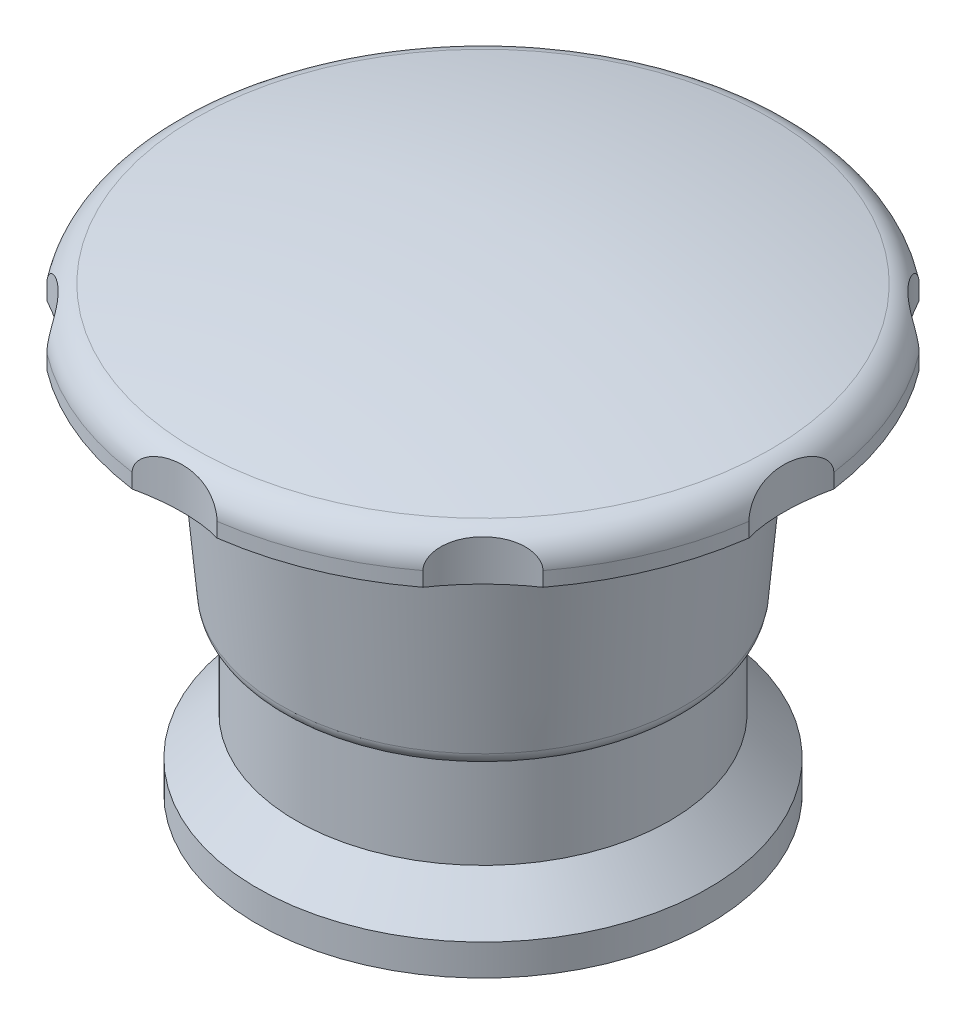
from build123d import *

# Parameters (mm, degrees)
ESQUISSE2_R                  = 7.5
ENL_V_MAT_EXTRU_1_DEPTH      = 50
R_P_TITION_CIRCULAIRE1_COUNT = 8


with BuildPart() as part:
    # Esquisse1 → R_volution1 (revolve)
    with BuildSketch(Plane.XY):
        with BuildLine():
            Line((0, 0), (-14.5, 0))
            Line((-14.5, 0), (-14.5, 2))
            Line((-14.5, 2), (-12, 4.5))
            Line((-12, 4.5), (-12, 10.5))
            ThreePointArc((-12, 10.5), (-12.675590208, 10.762722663), (-12.996194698, 11.412844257))
            Line((-12.996194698, 11.412844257), (-13.968064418, 22.521365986))
            ThreePointArc((-13.968064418, 22.521365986), (-14.428364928, 23.63262972), (-15.442815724, 24.278906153))
            Line((-15.442815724, 24.278906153), (-20, 25.5))
            Line((-20, 25.5), (-20, 26.428769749))
            ThreePointArc((-20, 26.428769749), (-19.566607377, 27.672048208), (-18.454258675, 28.376498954))
            ThreePointArc((-18.454258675, 28.376498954), (-9.288015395, 29.967378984), (0, 30.5))
            Line((0, 30.5), (0, 0))
        make_face()
    revolve(axis=Axis((0, 0, 0), (0, -1, 0)))

    # Esquisse2 → Enl_v. mat.-Extru.1 (cut)
    with BuildSketch(Plane.XZ):
        with Locations((0, 26.8)):
            Circle(ESQUISSE2_R)
    enl_v_mat_extru_1 = extrude(amount=-ENL_V_MAT_EXTRU_1_DEPTH, mode=Mode.SUBTRACT)

    # R_p_tition circulaire1: Enl_v. mat.-Extru.1 ×8 about axis
    r_p_tition_circulaire1_axis = Axis((0, 0, 0), (0, 1, 0))
    for i in range(1, R_P_TITION_CIRCULAIRE1_COUNT):
        add(enl_v_mat_extru_1.rotate(r_p_tition_circulaire1_axis, i * 360 / R_P_TITION_CIRCULAIRE1_COUNT), mode=Mode.SUBTRACT)


solid = part.part
